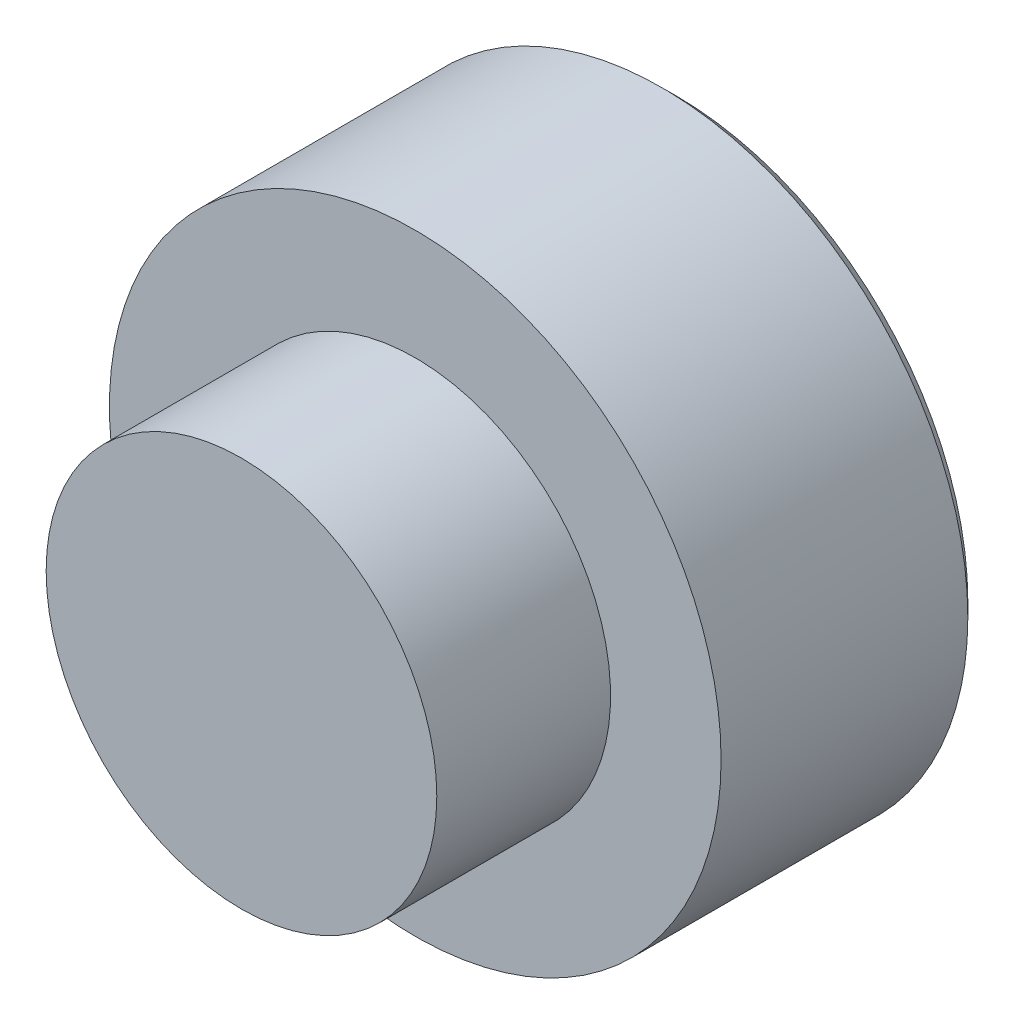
ISO-10303-21;
HEADER;
FILE_DESCRIPTION(('STEP AP214'),'2;1');
FILE_NAME('part.step','',(''),(''),'','','');
FILE_SCHEMA(('AUTOMOTIVE_DESIGN { 1 0 10303 214 1 1 1 1 }'));
ENDSEC;
DATA;
#1=APPLICATION_CONTEXT('core data for automotive mechanical design processes');
#2=APPLICATION_PROTOCOL_DEFINITION('international standard','automotive_design',2000,#1);
#3=PRODUCT_CONTEXT('',#1,'mechanical');
#4=PRODUCT('Part','Part','',(#3));
#5=PRODUCT_RELATED_PRODUCT_CATEGORY('part','',(#4));
#6=PRODUCT_DEFINITION_FORMATION('','',#4);
#7=PRODUCT_DEFINITION_CONTEXT('part definition',#1,'design');
#8=PRODUCT_DEFINITION('design','',#6,#7);
#9=PRODUCT_DEFINITION_SHAPE('','',#8);
#10=(LENGTH_UNIT() NAMED_UNIT(*) SI_UNIT(.MILLI.,.METRE.));
#11=(NAMED_UNIT(*) PLANE_ANGLE_UNIT() SI_UNIT($,.RADIAN.));
#12=(NAMED_UNIT(*) SI_UNIT($,.STERADIAN.) SOLID_ANGLE_UNIT());
#13=UNCERTAINTY_MEASURE_WITH_UNIT(LENGTH_MEASURE(1.E-05),#10,'distance_accuracy_value','');
#14=(GEOMETRIC_REPRESENTATION_CONTEXT(3) GLOBAL_UNCERTAINTY_ASSIGNED_CONTEXT((#13)) GLOBAL_UNIT_ASSIGNED_CONTEXT((#10,
#11,#12)) REPRESENTATION_CONTEXT('',''));
#15=CARTESIAN_POINT('',(0.,0.,0.));
#16=DIRECTION('',(0.,0.,1.));
#17=DIRECTION('',(1.,0.,0.));
#18=AXIS2_PLACEMENT_3D('',#15,#16,#17);
#19=CARTESIAN_POINT('',(0.,0.,3.175));
#20=DIRECTION('',(0.,0.,-1.));
#21=DIRECTION('',(-1.,0.,0.));
#22=AXIS2_PLACEMENT_3D('',#19,#20,#21);
#23=CYLINDRICAL_SURFACE('',#22,3.5687);
#24=CARTESIAN_POINT('',(0.,0.,3.175));
#25=DIRECTION('',(0.,0.,1.));
#26=DIRECTION('',(1.,0.,0.));
#27=AXIS2_PLACEMENT_3D('',#24,#25,#26);
#28=CIRCLE('',#27,3.5687);
#29=CARTESIAN_POINT('',(3.5687,0.,3.175));
#30=VERTEX_POINT('',#29);
#31=EDGE_CURVE('E46',#30,#30,#28,.T.);
#32=ORIENTED_EDGE('',*,*,#31,.F.);
#33=EDGE_LOOP('',(#32));
#34=FACE_BOUND('',#33,.T.);
#35=CARTESIAN_POINT('',(0.,0.,0.));
#36=DIRECTION('',(0.,0.,-1.));
#37=DIRECTION('',(-1.,0.,0.));
#38=AXIS2_PLACEMENT_3D('',#35,#36,#37);
#39=CIRCLE('',#38,3.5687);
#40=CARTESIAN_POINT('',(-3.5687,0.,0.));
#41=VERTEX_POINT('',#40);
#42=EDGE_CURVE('E50',#41,#41,#39,.T.);
#43=ORIENTED_EDGE('',*,*,#42,.F.);
#44=EDGE_LOOP('',(#43));
#45=FACE_BOUND('',#44,.T.);
#46=ADVANCED_FACE('F35',(#34,#45),#23,.T.);
#47=CARTESIAN_POINT('',(0.,0.,3.175));
#48=DIRECTION('',(0.,0.,1.));
#49=DIRECTION('',(1.,0.,0.));
#50=AXIS2_PLACEMENT_3D('',#47,#48,#49);
#51=PLANE('',#50);
#52=ORIENTED_EDGE('',*,*,#31,.T.);
#53=EDGE_LOOP('',(#52));
#54=FACE_BOUND('',#53,.T.);
#55=ADVANCED_FACE('F64',(#54),#51,.T.);
#56=CARTESIAN_POINT('',(0.,0.,0.));
#57=DIRECTION('',(0.,0.,-1.));
#58=DIRECTION('',(-1.,0.,0.));
#59=AXIS2_PLACEMENT_3D('',#56,#57,#58);
#60=PLANE('',#59);
#61=CARTESIAN_POINT('',(0.,0.,0.));
#62=DIRECTION('',(0.,0.,-1.));
#63=DIRECTION('',(-1.,0.,0.));
#64=AXIS2_PLACEMENT_3D('',#61,#62,#63);
#65=CIRCLE('',#64,5.588);
#66=CARTESIAN_POINT('',(5.588,0.,0.));
#67=VERTEX_POINT('',#66);
#68=EDGE_CURVE('E55',#67,#67,#65,.T.);
#69=ORIENTED_EDGE('',*,*,#68,.F.);
#70=EDGE_LOOP('',(#69));
#71=FACE_BOUND('',#70,.T.);
#72=ORIENTED_EDGE('',*,*,#42,.T.);
#73=EDGE_LOOP('',(#72));
#74=FACE_BOUND('',#73,.T.);
#75=ADVANCED_FACE('F61',(#71,#74),#60,.F.);
#76=CARTESIAN_POINT('',(0.,0.,-4.7625));
#77=DIRECTION('',(0.,0.,1.));
#78=DIRECTION('',(1.,0.,0.));
#79=AXIS2_PLACEMENT_3D('',#76,#77,#78);
#80=CYLINDRICAL_SURFACE('',#79,5.588);
#81=CARTESIAN_POINT('',(0.,0.,-4.5085));
#82=DIRECTION('',(0.,0.,-1.));
#83=DIRECTION('',(-1.,0.,0.));
#84=AXIS2_PLACEMENT_3D('',#81,#82,#83);
#85=CIRCLE('',#84,5.588);
#86=CARTESIAN_POINT('',(5.588,0.,-4.5085));
#87=VERTEX_POINT('',#86);
#88=EDGE_CURVE('E10',#87,#87,#85,.F.);
#89=CARTESIAN_POINT('',(5.588,0.,-4.5085));
#90=CARTESIAN_POINT('',(5.588,0.,-4.46153645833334));
#91=CARTESIAN_POINT('',(5.588,0.,-4.41457291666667));
#92=CARTESIAN_POINT('',(5.588,0.,-4.32064583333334));
#93=CARTESIAN_POINT('',(5.588,0.,-4.27368229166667));
#94=CARTESIAN_POINT('',(5.588,0.,-4.17975520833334));
#95=CARTESIAN_POINT('',(5.588,0.,-4.13279166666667));
#96=CARTESIAN_POINT('',(5.588,0.,-4.03886458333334));
#97=CARTESIAN_POINT('',(5.588,0.,-3.99190104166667));
#98=CARTESIAN_POINT('',(5.588,0.,-3.89797395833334));
#99=CARTESIAN_POINT('',(5.588,0.,-3.85101041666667));
#100=CARTESIAN_POINT('',(5.588,0.,-3.75708333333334));
#101=CARTESIAN_POINT('',(5.588,0.,-3.71011979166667));
#102=CARTESIAN_POINT('',(5.588,0.,-3.61619270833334));
#103=CARTESIAN_POINT('',(5.588,0.,-3.56922916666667));
#104=CARTESIAN_POINT('',(5.588,0.,-3.47530208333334));
#105=CARTESIAN_POINT('',(5.588,0.,-3.42833854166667));
#106=CARTESIAN_POINT('',(5.588,0.,-3.33441145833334));
#107=CARTESIAN_POINT('',(5.588,0.,-3.28744791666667));
#108=CARTESIAN_POINT('',(5.588,0.,-3.19352083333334));
#109=CARTESIAN_POINT('',(5.588,0.,-3.14655729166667));
#110=CARTESIAN_POINT('',(5.588,0.,-3.05263020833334));
#111=CARTESIAN_POINT('',(5.588,0.,-3.00566666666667));
#112=CARTESIAN_POINT('',(5.588,0.,-2.91173958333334));
#113=CARTESIAN_POINT('',(5.588,0.,-2.86477604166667));
#114=CARTESIAN_POINT('',(5.588,0.,-2.77084895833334));
#115=CARTESIAN_POINT('',(5.588,0.,-2.72388541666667));
#116=CARTESIAN_POINT('',(5.588,0.,-2.62995833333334));
#117=CARTESIAN_POINT('',(5.588,0.,-2.58299479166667));
#118=CARTESIAN_POINT('',(5.588,0.,-2.48906770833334));
#119=CARTESIAN_POINT('',(5.588,0.,-2.44210416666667));
#120=CARTESIAN_POINT('',(5.588,0.,-2.34817708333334));
#121=CARTESIAN_POINT('',(5.588,0.,-2.30121354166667));
#122=CARTESIAN_POINT('',(5.588,0.,-2.20728645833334));
#123=CARTESIAN_POINT('',(5.588,0.,-2.16032291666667));
#124=CARTESIAN_POINT('',(5.588,0.,-2.06639583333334));
#125=CARTESIAN_POINT('',(5.588,0.,-2.01943229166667));
#126=CARTESIAN_POINT('',(5.588,0.,-1.92550520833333));
#127=CARTESIAN_POINT('',(5.588,0.,-1.87854166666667));
#128=CARTESIAN_POINT('',(5.588,0.,-1.78461458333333));
#129=CARTESIAN_POINT('',(5.588,0.,-1.73765104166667));
#130=CARTESIAN_POINT('',(5.588,0.,-1.64372395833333));
#131=CARTESIAN_POINT('',(5.588,0.,-1.59676041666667));
#132=CARTESIAN_POINT('',(5.588,0.,-1.50283333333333));
#133=CARTESIAN_POINT('',(5.588,0.,-1.45586979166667));
#134=CARTESIAN_POINT('',(5.588,0.,-1.36194270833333));
#135=CARTESIAN_POINT('',(5.588,0.,-1.31497916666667));
#136=CARTESIAN_POINT('',(5.588,0.,-1.22105208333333));
#137=CARTESIAN_POINT('',(5.588,0.,-1.17408854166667));
#138=CARTESIAN_POINT('',(5.588,0.,-1.08016145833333));
#139=CARTESIAN_POINT('',(5.588,0.,-1.03319791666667));
#140=CARTESIAN_POINT('',(5.588,0.,-0.939270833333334));
#141=CARTESIAN_POINT('',(5.588,0.,-0.892307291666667));
#142=CARTESIAN_POINT('',(5.588,0.,-0.798380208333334));
#143=CARTESIAN_POINT('',(5.588,0.,-0.751416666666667));
#144=CARTESIAN_POINT('',(5.588,0.,-0.657489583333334));
#145=CARTESIAN_POINT('',(5.588,0.,-0.610526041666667));
#146=CARTESIAN_POINT('',(5.588,0.,-0.516598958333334));
#147=CARTESIAN_POINT('',(5.588,0.,-0.469635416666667));
#148=CARTESIAN_POINT('',(5.588,0.,-0.375708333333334));
#149=CARTESIAN_POINT('',(5.588,0.,-0.328744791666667));
#150=CARTESIAN_POINT('',(5.588,0.,-0.234817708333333));
#151=CARTESIAN_POINT('',(5.588,0.,-0.187854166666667));
#152=CARTESIAN_POINT('',(5.588,0.,-0.0939270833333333));
#153=CARTESIAN_POINT('',(5.588,0.,-0.0469635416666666));
#154=CARTESIAN_POINT('',(5.588,0.,0.));
#155=B_SPLINE_CURVE_WITH_KNOTS('',3,(#89,#90,#91,#92,#93,#94,#95,#96,#97,#98,#99,#100,#101,#102,
#103,#104,#105,#106,#107,#108,#109,#110,#111,#112,#113,#114,#115,#116,#117,#118,#119,#120,#121,
#122,#123,#124,#125,#126,#127,#128,#129,#130,#131,#132,#133,#134,#135,#136,#137,#138,#139,#140,
#141,#142,#143,#144,#145,#146,#147,#148,#149,#150,#151,#152,#153,#154),.UNSPECIFIED.,.F.,.F.,(4,
2,2,2,2,2,2,2,2,2,2,2,2,2,2,2,2,2,2,2,2,2,2,2,2,2,2,2,2,2,2,2,4),(0.,0.140890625,0.28178125,
0.422671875,0.5635625,0.704453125,0.84534375,0.986234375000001,1.127125,1.268015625,1.40890625,
1.549796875,1.6906875,1.831578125,1.97246875,2.113359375,2.25425,2.395140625,2.53603125,
2.676921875,2.8178125,2.958703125,3.09959375,3.240484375,3.381375,3.522265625,3.66315625,
3.804046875,3.9449375,4.085828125,4.22671875,4.367609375,4.5085),.UNSPECIFIED.);
#156=EDGE_CURVE('BSEAM59',#87,#67,#155,.T.);
#157=ORIENTED_EDGE('',*,*,#88,.T.);
#158=ORIENTED_EDGE('',*,*,#68,.T.);
#159=ORIENTED_EDGE('',*,*,#156,.T.);
#160=ORIENTED_EDGE('',*,*,#156,.F.);
#161=EDGE_LOOP('',(#157,#159,#158,#160));
#162=FACE_BOUND('',#161,.T.);
#163=ADVANCED_FACE('F59',(#162),#80,.T.);
#164=CARTESIAN_POINT('',(0.,0.,-4.7625));
#165=DIRECTION('',(0.,0.,-1.));
#166=DIRECTION('',(-1.,0.,0.));
#167=AXIS2_PLACEMENT_3D('',#164,#165,#166);
#168=PLANE('',#167);
#169=CARTESIAN_POINT('',(0.,0.,-4.7625));
#170=DIRECTION('',(0.,0.,-1.));
#171=DIRECTION('',(-1.,0.,0.));
#172=AXIS2_PLACEMENT_3D('',#169,#170,#171);
#173=CIRCLE('',#172,5.334);
#174=CARTESIAN_POINT('',(-5.334,0.,-4.7625));
#175=VERTEX_POINT('',#174);
#176=EDGE_CURVE('E42',#175,#175,#173,.T.);
#177=ORIENTED_EDGE('',*,*,#176,.T.);
#178=EDGE_LOOP('',(#177));
#179=FACE_BOUND('',#178,.T.);
#180=ADVANCED_FACE('F78',(#179),#168,.T.);
#181=CARTESIAN_POINT('',(0.,0.,-4.7625));
#182=DIRECTION('',(0.,0.,1.));
#183=DIRECTION('',(1.,0.,0.));
#184=AXIS2_PLACEMENT_3D('',#181,#182,#183);
#185=CONICAL_SURFACE('',#184,5.334,0.785398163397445);
#186=ORIENTED_EDGE('',*,*,#88,.F.);
#187=EDGE_LOOP('',(#186));
#188=FACE_BOUND('',#187,.T.);
#189=ORIENTED_EDGE('',*,*,#176,.F.);
#190=EDGE_LOOP('',(#189));
#191=FACE_BOUND('',#190,.T.);
#192=ADVANCED_FACE('F37',(#188,#191),#185,.T.);
#193=CLOSED_SHELL('',(#46,#55,#75,#163,#180,#192));
#194=MANIFOLD_SOLID_BREP('B2',#193);
#195=ADVANCED_BREP_SHAPE_REPRESENTATION('',(#18,#194),#14);
#196=SHAPE_DEFINITION_REPRESENTATION(#9,#195);
ENDSEC;
END-ISO-10303-21;
